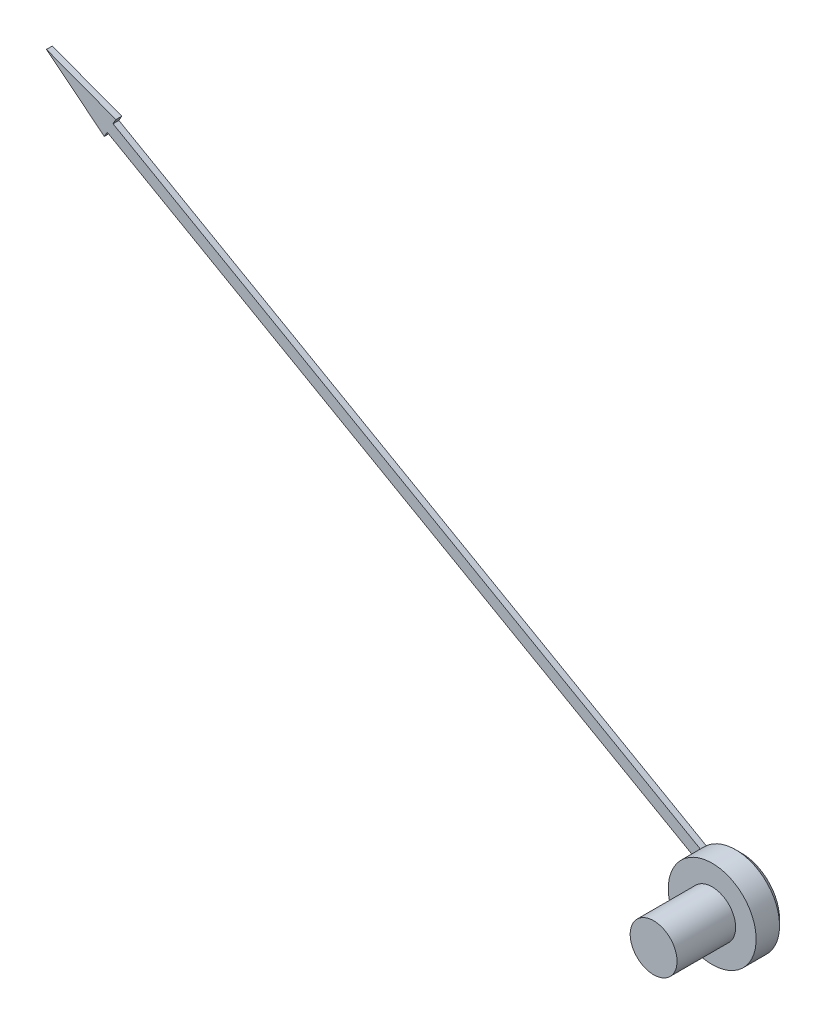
ISO-10303-21;
HEADER;
FILE_DESCRIPTION(('STEP AP214'),'2;1');
FILE_NAME('part.step','',(''),(''),'','','');
FILE_SCHEMA(('AUTOMOTIVE_DESIGN { 1 0 10303 214 1 1 1 1 }'));
ENDSEC;
DATA;
#1=APPLICATION_CONTEXT('core data for automotive mechanical design processes');
#2=APPLICATION_PROTOCOL_DEFINITION('international standard','automotive_design',2000,#1);
#3=PRODUCT_CONTEXT('',#1,'mechanical');
#4=PRODUCT('Part','Part','',(#3));
#5=PRODUCT_RELATED_PRODUCT_CATEGORY('part','',(#4));
#6=PRODUCT_DEFINITION_FORMATION('','',#4);
#7=PRODUCT_DEFINITION_CONTEXT('part definition',#1,'design');
#8=PRODUCT_DEFINITION('design','',#6,#7);
#9=PRODUCT_DEFINITION_SHAPE('','',#8);
#10=(LENGTH_UNIT() NAMED_UNIT(*) SI_UNIT(.MILLI.,.METRE.));
#11=(NAMED_UNIT(*) PLANE_ANGLE_UNIT() SI_UNIT($,.RADIAN.));
#12=(NAMED_UNIT(*) SI_UNIT($,.STERADIAN.) SOLID_ANGLE_UNIT());
#13=UNCERTAINTY_MEASURE_WITH_UNIT(LENGTH_MEASURE(1.E-05),#10,'distance_accuracy_value','');
#14=(GEOMETRIC_REPRESENTATION_CONTEXT(3) GLOBAL_UNCERTAINTY_ASSIGNED_CONTEXT((#13)) GLOBAL_UNIT_ASSIGNED_CONTEXT((#10,
#11,#12)) REPRESENTATION_CONTEXT('',''));
#15=CARTESIAN_POINT('',(0.,0.,0.));
#16=DIRECTION('',(0.,0.,1.));
#17=DIRECTION('',(1.,0.,0.));
#18=AXIS2_PLACEMENT_3D('',#15,#16,#17);
#19=CARTESIAN_POINT('',(0.,0.,20.));
#20=DIRECTION('',(0.,0.,-1.));
#21=DIRECTION('',(-1.,0.,0.));
#22=AXIS2_PLACEMENT_3D('',#19,#20,#21);
#23=CYLINDRICAL_SURFACE('',#22,8.);
#24=CARTESIAN_POINT('',(0.,0.,20.));
#25=DIRECTION('',(0.,0.,1.));
#26=DIRECTION('',(1.,0.,0.));
#27=AXIS2_PLACEMENT_3D('',#24,#25,#26);
#28=CIRCLE('',#27,8.);
#29=CARTESIAN_POINT('',(8.,0.,20.));
#30=VERTEX_POINT('',#29);
#31=EDGE_CURVE('E148',#30,#30,#28,.T.);
#32=ORIENTED_EDGE('',*,*,#31,.F.);
#33=EDGE_LOOP('',(#32));
#34=FACE_BOUND('',#33,.T.);
#35=CARTESIAN_POINT('',(0.,0.,0.));
#36=DIRECTION('',(0.,0.,1.));
#37=DIRECTION('',(1.,0.,0.));
#38=AXIS2_PLACEMENT_3D('',#35,#36,#37);
#39=CIRCLE('',#38,8.);
#40=CARTESIAN_POINT('',(8.,0.,0.));
#41=VERTEX_POINT('',#40);
#42=EDGE_CURVE('E145',#41,#41,#39,.T.);
#43=ORIENTED_EDGE('',*,*,#42,.T.);
#44=EDGE_LOOP('',(#43));
#45=FACE_BOUND('',#44,.T.);
#46=ADVANCED_FACE('F26',(#34,#45),#23,.T.);
#47=CARTESIAN_POINT('',(0.,0.,20.));
#48=DIRECTION('',(0.,0.,1.));
#49=DIRECTION('',(1.,0.,0.));
#50=AXIS2_PLACEMENT_3D('',#47,#48,#49);
#51=PLANE('',#50);
#52=ORIENTED_EDGE('',*,*,#31,.T.);
#53=EDGE_LOOP('',(#52));
#54=FACE_BOUND('',#53,.T.);
#55=ADVANCED_FACE('F186',(#54),#51,.T.);
#56=CARTESIAN_POINT('',(0.,0.,-10.));
#57=DIRECTION('',(0.,0.,1.));
#58=DIRECTION('',(1.,0.,0.));
#59=AXIS2_PLACEMENT_3D('',#56,#57,#58);
#60=CYLINDRICAL_SURFACE('',#59,15.);
#61=CARTESIAN_POINT('',(0.,0.,-7.99999999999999));
#62=DIRECTION('',(0.,0.,-1.));
#63=DIRECTION('',(-1.,0.,0.));
#64=AXIS2_PLACEMENT_3D('',#61,#62,#63);
#65=CIRCLE('',#64,15.);
#66=CARTESIAN_POINT('',(-11.9291890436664,9.09364881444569,-8.));
#67=VERTEX_POINT('',#66);
#68=CARTESIAN_POINT('',(-13.9083611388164,5.61760540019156,-8.));
#69=VERTEX_POINT('',#68);
#70=EDGE_CURVE('E53',#67,#69,#65,.F.);
#71=ORIENTED_EDGE('',*,*,#70,.T.);
#72=EDGE_CURVE('E153',#69,#67,#65,.F.);
#73=ORIENTED_EDGE('',*,*,#72,.T.);
#74=EDGE_LOOP('',(#71,#73));
#75=FACE_BOUND('',#74,.T.);
#76=CARTESIAN_POINT('',(0.,0.,0.));
#77=DIRECTION('',(0.,0.,-1.));
#78=DIRECTION('',(-1.,0.,0.));
#79=AXIS2_PLACEMENT_3D('',#76,#77,#78);
#80=CIRCLE('',#79,15.);
#81=CARTESIAN_POINT('',(-15.,0.,0.));
#82=VERTEX_POINT('',#81);
#83=EDGE_CURVE('E136',#82,#82,#80,.T.);
#84=ORIENTED_EDGE('',*,*,#83,.T.);
#85=EDGE_LOOP('',(#84));
#86=FACE_BOUND('',#85,.T.);
#87=ADVANCED_FACE('F191',(#75,#86),#60,.T.);
#88=CARTESIAN_POINT('',(0.,0.,-10.));
#89=DIRECTION('',(0.,0.,-1.));
#90=DIRECTION('',(-1.,0.,0.));
#91=AXIS2_PLACEMENT_3D('',#88,#89,#90);
#92=PLANE('',#91);
#93=CARTESIAN_POINT('',(0.,0.,-10.));
#94=DIRECTION('',(0.,0.,-1.));
#95=DIRECTION('',(-1.,0.,0.));
#96=AXIS2_PLACEMENT_3D('',#93,#94,#95);
#97=CIRCLE('',#96,13.);
#98=CARTESIAN_POINT('',(-10.1730604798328,8.09375317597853,-10.));
#99=VERTEX_POINT('',#98);
#100=CARTESIAN_POINT('',(-12.1522325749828,4.6177097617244,-10.));
#101=VERTEX_POINT('',#100);
#102=EDGE_CURVE('E151',#99,#101,#97,.T.);
#103=ORIENTED_EDGE('',*,*,#102,.T.);
#104=DIRECTION('',(-0.869010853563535,0.494793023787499,0.));
#105=VECTOR('',#104,1.);
#106=CARTESIAN_POINT('',(-0.989586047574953,-1.738021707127,-10.));
#107=LINE('',#106,#105);
#108=CARTESIAN_POINT('',(-214.556689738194,119.861740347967,-10.));
#109=VERTEX_POINT('',#108);
#110=EDGE_CURVE('E119',#101,#109,#107,.T.);
#111=ORIENTED_EDGE('',*,*,#110,.T.);
#112=DIRECTION('',(-0.494793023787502,-0.869010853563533,0.));
#113=VECTOR('',#112,1.);
#114=CARTESIAN_POINT('',(-214.556689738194,119.861740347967,-10.));
#115=LINE('',#114,#113);
#116=CARTESIAN_POINT('',(-215.546275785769,118.12371864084,-10.));
#117=VERTEX_POINT('',#116);
#118=EDGE_CURVE('E114',#109,#117,#115,.T.);
#119=ORIENTED_EDGE('',*,*,#118,.T.);
#120=DIRECTION('',(-0.779965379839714,0.625822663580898,0.));
#121=VECTOR('',#120,1.);
#122=CARTESIAN_POINT('',(-215.546275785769,118.12371864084,-10.));
#123=LINE('',#122,#121);
#124=CARTESIAN_POINT('',(-235.301579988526,133.97482872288,-10.));
#125=VERTEX_POINT('',#124);
#126=EDGE_CURVE('E96',#117,#125,#123,.T.);
#127=ORIENTED_EDGE('',*,*,#126,.T.);
#128=DIRECTION('',(0.936246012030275,-0.351345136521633,0.));
#129=VECTOR('',#128,1.);
#130=CARTESIAN_POINT('',(-211.587931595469,125.075805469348,-10.));
#131=LINE('',#130,#129);
#132=CARTESIAN_POINT('',(-211.587931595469,125.075805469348,-10.));
#133=VERTEX_POINT('',#132);
#134=EDGE_CURVE('E107',#125,#133,#131,.T.);
#135=ORIENTED_EDGE('',*,*,#134,.T.);
#136=DIRECTION('',(-0.494793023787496,-0.869010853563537,0.));
#137=VECTOR('',#136,1.);
#138=CARTESIAN_POINT('',(-212.577517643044,123.337783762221,-10.));
#139=LINE('',#138,#137);
#140=CARTESIAN_POINT('',(-212.577517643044,123.337783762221,-10.));
#141=VERTEX_POINT('',#140);
#142=EDGE_CURVE('E110',#133,#141,#139,.T.);
#143=ORIENTED_EDGE('',*,*,#142,.T.);
#144=DIRECTION('',(0.869010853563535,-0.494793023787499,0.));
#145=VECTOR('',#144,1.);
#146=CARTESIAN_POINT('',(0.989586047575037,1.73802170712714,-10.));
#147=LINE('',#146,#145);
#148=EDGE_CURVE('E45',#141,#99,#147,.T.);
#149=ORIENTED_EDGE('',*,*,#148,.T.);
#150=EDGE_LOOP('',(#103,#111,#119,#127,#135,#143,#149));
#151=FACE_BOUND('',#150,.T.);
#152=ADVANCED_FACE('F112',(#151),#92,.T.);
#153=CARTESIAN_POINT('',(0.,0.,0.));
#154=DIRECTION('',(0.,0.,-1.));
#155=DIRECTION('',(-1.,0.,0.));
#156=AXIS2_PLACEMENT_3D('',#153,#154,#155);
#157=PLANE('',#156);
#158=ORIENTED_EDGE('',*,*,#42,.F.);
#159=EDGE_LOOP('',(#158));
#160=FACE_BOUND('',#159,.T.);
#161=ORIENTED_EDGE('',*,*,#83,.F.);
#162=EDGE_LOOP('',(#161));
#163=FACE_BOUND('',#162,.T.);
#164=ADVANCED_FACE('F183',(#160,#163),#157,.F.);
#165=CARTESIAN_POINT('',(0.,0.,-10.));
#166=DIRECTION('',(0.,0.,1.));
#167=DIRECTION('',(1.,0.,0.));
#168=AXIS2_PLACEMENT_3D('',#165,#166,#167);
#169=CONICAL_SURFACE('',#168,13.,0.785398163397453);
#170=CARTESIAN_POINT('',(-2.35271421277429,-0.961890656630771,-20.4582490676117));
#171=CARTESIAN_POINT('',(-2.39907762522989,-0.935492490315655,-20.4253154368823));
#172=CARTESIAN_POINT('',(-2.44503847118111,-0.909323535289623,-20.3916453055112));
#173=CARTESIAN_POINT('',(-2.53623866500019,-0.857396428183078,-20.3230523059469));
#174=CARTESIAN_POINT('',(-2.58147813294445,-0.831638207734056,-20.2881296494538));
#175=CARTESIAN_POINT('',(-2.7162056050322,-0.754927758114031,-20.1818414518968));
#176=CARTESIAN_POINT('',(-2.80476171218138,-0.704506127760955,-20.1089130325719));
#177=CARTESIAN_POINT('',(-2.97979948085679,-0.604844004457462,-19.960189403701));
#178=CARTESIAN_POINT('',(-3.06628425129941,-0.555601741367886,-19.8843989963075));
#179=CARTESIAN_POINT('',(-3.23776585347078,-0.457964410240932,-19.7305901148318));
#180=CARTESIAN_POINT('',(-3.32276240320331,-0.409569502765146,-19.6525712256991));
#181=CARTESIAN_POINT('',(-3.49140675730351,-0.313547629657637,-19.4949985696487));
#182=CARTESIAN_POINT('',(-3.57505678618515,-0.265919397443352,-19.4154479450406));
#183=CARTESIAN_POINT('',(-3.74140709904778,-0.171203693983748,-19.2550418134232));
#184=CARTESIAN_POINT('',(-3.82410736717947,-0.12411623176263,-19.1741862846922));
#185=CARTESIAN_POINT('',(-3.98877688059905,-0.0303575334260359,-19.0114025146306));
#186=CARTESIAN_POINT('',(-4.07074574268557,0.0163134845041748,-18.9294737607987));
#187=CARTESIAN_POINT('',(-4.23404921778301,0.109294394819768,-18.7647814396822));
#188=CARTESIAN_POINT('',(-4.31538382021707,0.155604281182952,-18.6820178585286));
#189=CARTESIAN_POINT('',(-4.55294733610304,0.290866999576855,-18.4385088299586));
#190=CARTESIAN_POINT('',(-4.70846248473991,0.379413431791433,-18.2768415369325));
#191=CARTESIAN_POINT('',(-5.01809924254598,0.555712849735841,-17.9517479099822));
#192=CARTESIAN_POINT('',(-5.17222082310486,0.643465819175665,-17.7883215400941));
#193=CARTESIAN_POINT('',(-5.47943599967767,0.81838644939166,-17.4601760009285));
#194=CARTESIAN_POINT('',(-5.63252953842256,0.905554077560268,-17.2954567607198));
#195=CARTESIAN_POINT('',(-5.9379271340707,1.07943982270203,-16.9650514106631));
#196=CARTESIAN_POINT('',(-6.09023118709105,1.16615793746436,-16.7993652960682));
#197=CARTESIAN_POINT('',(-6.54621041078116,1.42578109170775,-16.3012284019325));
#198=CARTESIAN_POINT('',(-6.84897530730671,1.59816784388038,-15.9676747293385));
#199=CARTESIAN_POINT('',(-7.45295513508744,1.94205883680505,-15.2987439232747));
#200=CARTESIAN_POINT('',(-7.75417012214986,2.11356310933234,-14.9633668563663));
#201=CARTESIAN_POINT('',(-8.3563851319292,2.45644925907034,-14.2904394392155));
#202=CARTESIAN_POINT('',(-8.65738224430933,2.62782947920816,-13.9528856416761));
#203=CARTESIAN_POINT('',(-9.25863194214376,2.97016600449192,-13.2768954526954));
#204=CARTESIAN_POINT('',(-9.558884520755,3.1411223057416,-12.9384590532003));
#205=CARTESIAN_POINT('',(-10.4588080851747,3.65351625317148,-11.9222284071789));
#206=CARTESIAN_POINT('',(-11.0576695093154,3.99449295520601,-11.2434851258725));
#207=CARTESIAN_POINT('',(-12.4083228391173,4.76352114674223,-9.70946185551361));
#208=CARTESIAN_POINT('',(-13.1597551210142,5.19136787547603,-8.85376304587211));
#209=CARTESIAN_POINT('',(-14.6615109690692,6.04643005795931,-7.14105491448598));
#210=CARTESIAN_POINT('',(-15.4118345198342,6.47364550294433,-6.28404557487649));
#211=CARTESIAN_POINT('',(-16.9088452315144,7.32600592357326,-4.57258066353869));
#212=CARTESIAN_POINT('',(-17.6555351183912,7.75115245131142,-3.71812824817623));
#213=CARTESIAN_POINT('',(-19.148424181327,8.60116610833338,-2.00868287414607));
#214=CARTESIAN_POINT('',(-19.8946233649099,9.02603324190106,-1.15368992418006));
#215=CARTESIAN_POINT('',(-20.6406892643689,9.45082448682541,-0.298543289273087));
#216=B_SPLINE_CURVE_WITH_KNOTS('',3,(#170,#171,#172,#173,#174,#175,#176,#177,#178,#179,#180,
#181,#182,#183,#184,#185,#186,#187,#188,#189,#190,#191,#192,#193,#194,#195,#196,#197,#198,#199,
#200,#201,#202,#203,#204,#205,#206,#207,#208,#209,#210,#211,#212,#213,#214,#215),.UNSPECIFIED.,
.F.,.F.,(4,2,2,2,2,2,2,2,2,2,2,2,2,2,2,2,2,2,2,2,2,2,4),(0.,0.188077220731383,0.376122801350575,
0.751973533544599,1.12721943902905,1.50253569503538,1.87715026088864,2.25177106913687,
2.62657781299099,3.00139079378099,3.72487391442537,4.44837185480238,5.17190977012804,
5.89545124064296,7.34242716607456,8.78935062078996,10.2402848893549,11.691232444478,
14.5930089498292,18.2425704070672,21.8921820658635,25.5274890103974,29.1627388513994),.UNSPECIFIED.);
#217=EDGE_CURVE('E11',#101,#69,#216,.T.);
#218=ORIENTED_EDGE('',*,*,#217,.F.);
#219=ORIENTED_EDGE('',*,*,#102,.F.);
#220=CARTESIAN_POINT('',(-11.9293644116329,9.09374866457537,-7.9998));
#221=CARTESIAN_POINT('',(-11.6368345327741,8.92718947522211,-8.33345202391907));
#222=CARTESIAN_POINT('',(-11.3441962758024,8.76056857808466,-8.66697803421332));
#223=CARTESIAN_POINT('',(-10.7587029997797,8.42720336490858,-9.33377803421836));
#224=CARTESIAN_POINT('',(-10.4658479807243,8.26045904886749,-9.66705202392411));
#225=CARTESIAN_POINT('',(-10.1728845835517,8.09365302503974,-10.0002));
#226=B_SPLINE_CURVE_WITH_KNOTS('',3,(#220,#221,#222,#223,#224,#225),.UNSPECIFIED.,.F.,.F.,(4,2,
4),(0.,1.4218837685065,2.84376756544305),.UNSPECIFIED.);
#227=EDGE_CURVE('E38',#67,#99,#226,.T.);
#228=ORIENTED_EDGE('',*,*,#227,.F.);
#229=ORIENTED_EDGE('',*,*,#72,.F.);
#230=EDGE_LOOP('',(#218,#219,#228,#229));
#231=FACE_BOUND('',#230,.T.);
#232=ADVANCED_FACE('F158',(#231),#169,.T.);
#233=CARTESIAN_POINT('',(-215.546275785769,118.12371864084,-8.));
#234=DIRECTION('',(-0.625822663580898,-0.779965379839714,0.));
#235=DIRECTION('',(0.779965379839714,-0.625822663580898,0.));
#236=AXIS2_PLACEMENT_3D('',#233,#234,#235);
#237=PLANE('',#236);
#238=ORIENTED_EDGE('',*,*,#126,.F.);
#239=DIRECTION('',(0.,0.,-1.));
#240=VECTOR('',#239,1.);
#241=CARTESIAN_POINT('',(-215.546275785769,118.12371864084,-8.));
#242=LINE('',#241,#240);
#243=CARTESIAN_POINT('',(-215.546275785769,118.12371864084,-8.));
#244=VERTEX_POINT('',#243);
#245=EDGE_CURVE('E134',#244,#117,#242,.T.);
#246=ORIENTED_EDGE('',*,*,#245,.F.);
#247=DIRECTION('',(-0.779965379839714,0.625822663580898,0.));
#248=VECTOR('',#247,1.);
#249=CARTESIAN_POINT('',(-215.546275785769,118.12371864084,-8.));
#250=LINE('',#249,#248);
#251=CARTESIAN_POINT('',(-235.301579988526,133.97482872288,-8.));
#252=VERTEX_POINT('',#251);
#253=EDGE_CURVE('E99',#244,#252,#250,.T.);
#254=ORIENTED_EDGE('',*,*,#253,.T.);
#255=DIRECTION('',(0.,0.,-1.));
#256=VECTOR('',#255,1.);
#257=CARTESIAN_POINT('',(-235.301579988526,133.97482872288,-8.));
#258=LINE('',#257,#256);
#259=EDGE_CURVE('E92',#252,#125,#258,.T.);
#260=ORIENTED_EDGE('',*,*,#259,.T.);
#261=EDGE_LOOP('',(#238,#246,#254,#260));
#262=FACE_BOUND('',#261,.T.);
#263=ADVANCED_FACE('F94',(#262),#237,.T.);
#264=CARTESIAN_POINT('',(-214.556689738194,119.861740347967,-8.));
#265=DIRECTION('',(0.869010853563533,-0.494793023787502,0.));
#266=DIRECTION('',(0.494793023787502,0.869010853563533,0.));
#267=AXIS2_PLACEMENT_3D('',#264,#265,#266);
#268=PLANE('',#267);
#269=ORIENTED_EDGE('',*,*,#118,.F.);
#270=DIRECTION('',(0.,0.,-1.));
#271=VECTOR('',#270,1.);
#272=CARTESIAN_POINT('',(-214.556689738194,119.861740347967,-8.));
#273=LINE('',#272,#271);
#274=CARTESIAN_POINT('',(-214.556689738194,119.861740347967,-8.));
#275=VERTEX_POINT('',#274);
#276=EDGE_CURVE('E137',#275,#109,#273,.T.);
#277=ORIENTED_EDGE('',*,*,#276,.F.);
#278=DIRECTION('',(-0.494793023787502,-0.869010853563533,0.));
#279=VECTOR('',#278,1.);
#280=CARTESIAN_POINT('',(-214.556689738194,119.861740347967,-8.));
#281=LINE('',#280,#279);
#282=EDGE_CURVE('E104',#275,#244,#281,.T.);
#283=ORIENTED_EDGE('',*,*,#282,.T.);
#284=ORIENTED_EDGE('',*,*,#245,.T.);
#285=EDGE_LOOP('',(#269,#277,#283,#284));
#286=FACE_BOUND('',#285,.T.);
#287=ADVANCED_FACE('F177',(#286),#268,.T.);
#288=CARTESIAN_POINT('',(-0.989586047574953,-1.738021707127,-8.));
#289=DIRECTION('',(-0.494793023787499,-0.869010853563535,0.));
#290=DIRECTION('',(0.869010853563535,-0.494793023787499,0.));
#291=AXIS2_PLACEMENT_3D('',#288,#289,#290);
#292=PLANE('',#291);
#293=ORIENTED_EDGE('',*,*,#110,.F.);
#294=ORIENTED_EDGE('',*,*,#217,.T.);
#295=DIRECTION('',(-0.869010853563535,0.494793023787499,0.));
#296=VECTOR('',#295,1.);
#297=CARTESIAN_POINT('',(-0.989586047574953,-1.738021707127,-8.));
#298=LINE('',#297,#296);
#299=EDGE_CURVE('E130',#69,#275,#298,.T.);
#300=ORIENTED_EDGE('',*,*,#299,.T.);
#301=ORIENTED_EDGE('',*,*,#276,.T.);
#302=EDGE_LOOP('',(#293,#294,#300,#301));
#303=FACE_BOUND('',#302,.T.);
#304=ADVANCED_FACE('F167',(#303),#292,.T.);
#305=CARTESIAN_POINT('',(0.989586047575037,1.73802170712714,-8.));
#306=DIRECTION('',(0.494793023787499,0.869010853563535,0.));
#307=DIRECTION('',(-0.869010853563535,0.494793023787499,0.));
#308=AXIS2_PLACEMENT_3D('',#305,#306,#307);
#309=PLANE('',#308);
#310=DIRECTION('',(0.869010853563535,-0.494793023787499,0.));
#311=VECTOR('',#310,1.);
#312=CARTESIAN_POINT('',(0.989586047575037,1.73802170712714,-8.));
#313=LINE('',#312,#311);
#314=CARTESIAN_POINT('',(-212.577517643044,123.337783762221,-8.));
#315=VERTEX_POINT('',#314);
#316=EDGE_CURVE('E128',#315,#67,#313,.T.);
#317=ORIENTED_EDGE('',*,*,#316,.T.);
#318=ORIENTED_EDGE('',*,*,#227,.T.);
#319=ORIENTED_EDGE('',*,*,#148,.F.);
#320=DIRECTION('',(0.,0.,-1.));
#321=VECTOR('',#320,1.);
#322=CARTESIAN_POINT('',(-212.577517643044,123.337783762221,-8.));
#323=LINE('',#322,#321);
#324=EDGE_CURVE('E140',#315,#141,#323,.T.);
#325=ORIENTED_EDGE('',*,*,#324,.F.);
#326=EDGE_LOOP('',(#317,#318,#319,#325));
#327=FACE_BOUND('',#326,.T.);
#328=ADVANCED_FACE('F162',(#327),#309,.T.);
#329=CARTESIAN_POINT('',(-212.577517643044,123.337783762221,-8.));
#330=DIRECTION('',(0.869010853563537,-0.494793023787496,0.));
#331=DIRECTION('',(0.494793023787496,0.869010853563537,0.));
#332=AXIS2_PLACEMENT_3D('',#329,#330,#331);
#333=PLANE('',#332);
#334=ORIENTED_EDGE('',*,*,#142,.F.);
#335=DIRECTION('',(0.,0.,-1.));
#336=VECTOR('',#335,1.);
#337=CARTESIAN_POINT('',(-211.587931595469,125.075805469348,-8.));
#338=LINE('',#337,#336);
#339=CARTESIAN_POINT('',(-211.587931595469,125.075805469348,-8.));
#340=VERTEX_POINT('',#339);
#341=EDGE_CURVE('E103',#340,#133,#338,.T.);
#342=ORIENTED_EDGE('',*,*,#341,.F.);
#343=DIRECTION('',(-0.494793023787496,-0.869010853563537,0.));
#344=VECTOR('',#343,1.);
#345=CARTESIAN_POINT('',(-212.577517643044,123.337783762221,-8.));
#346=LINE('',#345,#344);
#347=EDGE_CURVE('E125',#340,#315,#346,.T.);
#348=ORIENTED_EDGE('',*,*,#347,.T.);
#349=ORIENTED_EDGE('',*,*,#324,.T.);
#350=EDGE_LOOP('',(#334,#342,#348,#349));
#351=FACE_BOUND('',#350,.T.);
#352=ADVANCED_FACE('F166',(#351),#333,.T.);
#353=CARTESIAN_POINT('',(-211.587931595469,125.075805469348,-8.));
#354=DIRECTION('',(0.351345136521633,0.936246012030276,0.));
#355=DIRECTION('',(-0.936246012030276,0.351345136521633,0.));
#356=AXIS2_PLACEMENT_3D('',#353,#354,#355);
#357=PLANE('',#356);
#358=ORIENTED_EDGE('',*,*,#134,.F.);
#359=ORIENTED_EDGE('',*,*,#259,.F.);
#360=DIRECTION('',(0.936246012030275,-0.351345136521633,0.));
#361=VECTOR('',#360,1.);
#362=CARTESIAN_POINT('',(-211.587931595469,125.075805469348,-8.));
#363=LINE('',#362,#361);
#364=EDGE_CURVE('E123',#252,#340,#363,.T.);
#365=ORIENTED_EDGE('',*,*,#364,.T.);
#366=ORIENTED_EDGE('',*,*,#341,.T.);
#367=EDGE_LOOP('',(#358,#359,#365,#366));
#368=FACE_BOUND('',#367,.T.);
#369=ADVANCED_FACE('F108',(#368),#357,.T.);
#370=CARTESIAN_POINT('',(-215.546275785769,118.12371864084,-8.));
#371=DIRECTION('',(0.,0.,1.));
#372=DIRECTION('',(1.,0.,0.));
#373=AXIS2_PLACEMENT_3D('',#370,#371,#372);
#374=PLANE('',#373);
#375=ORIENTED_EDGE('',*,*,#299,.F.);
#376=ORIENTED_EDGE('',*,*,#70,.F.);
#377=ORIENTED_EDGE('',*,*,#316,.F.);
#378=ORIENTED_EDGE('',*,*,#347,.F.);
#379=ORIENTED_EDGE('',*,*,#364,.F.);
#380=ORIENTED_EDGE('',*,*,#253,.F.);
#381=ORIENTED_EDGE('',*,*,#282,.F.);
#382=EDGE_LOOP('',(#375,#376,#377,#378,#379,#380,#381));
#383=FACE_BOUND('',#382,.T.);
#384=ADVANCED_FACE('F175',(#383),#374,.T.);
#385=CLOSED_SHELL('',(#46,#55,#87,#152,#164,#232,#263,#287,#304,#328,#352,#369,#384));
#386=MANIFOLD_SOLID_BREP('B2',#385);
#387=ADVANCED_BREP_SHAPE_REPRESENTATION('',(#18,#386),#14);
#388=SHAPE_DEFINITION_REPRESENTATION(#9,#387);
ENDSEC;
END-ISO-10303-21;
